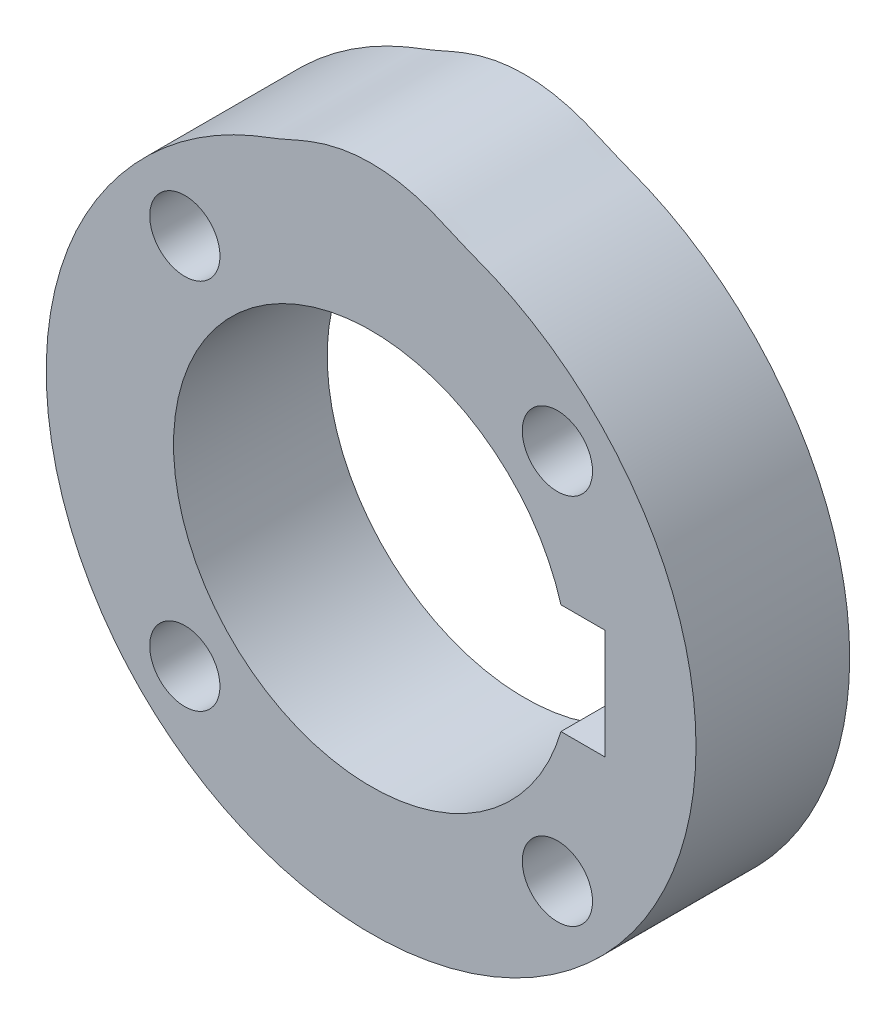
ISO-10303-21;
HEADER;
FILE_DESCRIPTION(('STEP AP214'),'2;1');
FILE_NAME('part.step','',(''),(''),'','','');
FILE_SCHEMA(('AUTOMOTIVE_DESIGN { 1 0 10303 214 1 1 1 1 }'));
ENDSEC;
DATA;
#1=APPLICATION_CONTEXT('core data for automotive mechanical design processes');
#2=APPLICATION_PROTOCOL_DEFINITION('international standard','automotive_design',2000,#1);
#3=PRODUCT_CONTEXT('',#1,'mechanical');
#4=PRODUCT('Part','Part','',(#3));
#5=PRODUCT_RELATED_PRODUCT_CATEGORY('part','',(#4));
#6=PRODUCT_DEFINITION_FORMATION('','',#4);
#7=PRODUCT_DEFINITION_CONTEXT('part definition',#1,'design');
#8=PRODUCT_DEFINITION('design','',#6,#7);
#9=PRODUCT_DEFINITION_SHAPE('','',#8);
#10=(LENGTH_UNIT() NAMED_UNIT(*) SI_UNIT(.MILLI.,.METRE.));
#11=(NAMED_UNIT(*) PLANE_ANGLE_UNIT() SI_UNIT($,.RADIAN.));
#12=(NAMED_UNIT(*) SI_UNIT($,.STERADIAN.) SOLID_ANGLE_UNIT());
#13=UNCERTAINTY_MEASURE_WITH_UNIT(LENGTH_MEASURE(1.E-05),#10,'distance_accuracy_value','');
#14=(GEOMETRIC_REPRESENTATION_CONTEXT(3) GLOBAL_UNCERTAINTY_ASSIGNED_CONTEXT((#13)) GLOBAL_UNIT_ASSIGNED_CONTEXT((#10,
#11,#12)) REPRESENTATION_CONTEXT('',''));
#15=CARTESIAN_POINT('',(0.,0.,0.));
#16=DIRECTION('',(0.,0.,1.));
#17=DIRECTION('',(1.,0.,0.));
#18=AXIS2_PLACEMENT_3D('',#15,#16,#17);
#19=CARTESIAN_POINT('',(0.,0.,14.));
#20=DIRECTION('',(0.,0.,1.));
#21=DIRECTION('',(1.,0.,0.));
#22=AXIS2_PLACEMENT_3D('',#19,#20,#21);
#23=PLANE('',#22);
#24=CARTESIAN_POINT('',(16.9705627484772,-16.9705627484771,14.));
#25=DIRECTION('',(0.,0.,1.));
#26=DIRECTION('',(1.,0.,0.));
#27=AXIS2_PLACEMENT_3D('',#24,#25,#26);
#28=CIRCLE('',#27,3.2);
#29=CARTESIAN_POINT('',(20.1705627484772,-16.9705627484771,14.));
#30=VERTEX_POINT('',#29);
#31=EDGE_CURVE('E183',#30,#30,#28,.T.);
#32=ORIENTED_EDGE('',*,*,#31,.F.);
#33=EDGE_LOOP('',(#32));
#34=FACE_BOUND('',#33,.T.);
#35=CARTESIAN_POINT('',(-16.9705627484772,16.9705627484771,14.));
#36=DIRECTION('',(0.,0.,1.));
#37=DIRECTION('',(1.,0.,0.));
#38=AXIS2_PLACEMENT_3D('',#35,#36,#37);
#39=CIRCLE('',#38,3.2);
#40=CARTESIAN_POINT('',(-13.7705627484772,16.9705627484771,14.));
#41=VERTEX_POINT('',#40);
#42=EDGE_CURVE('E90',#41,#41,#39,.T.);
#43=ORIENTED_EDGE('',*,*,#42,.F.);
#44=EDGE_LOOP('',(#43));
#45=FACE_BOUND('',#44,.T.);
#46=CARTESIAN_POINT('',(-22.8216800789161,18.8944464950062,14.));
#47=CARTESIAN_POINT('',(-22.7806762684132,18.9451245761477,14.));
#48=CARTESIAN_POINT('',(-22.6306491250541,19.1293817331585,14.));
#49=CARTESIAN_POINT('',(-22.3681874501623,19.4444235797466,14.));
#50=CARTESIAN_POINT('',(-22.0305061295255,19.836378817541,14.));
#51=CARTESIAN_POINT('',(-21.6864169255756,20.2228843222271,14.));
#52=CARTESIAN_POINT('',(-21.3359060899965,20.6038375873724,14.));
#53=CARTESIAN_POINT('',(-20.9789753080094,20.9789753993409,14.));
#54=CARTESIAN_POINT('',(-20.6159652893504,21.3484957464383,14.));
#55=CARTESIAN_POINT('',(-20.2466704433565,21.7119351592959,14.));
#56=CARTESIAN_POINT('',(-19.8713227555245,22.069386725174,14.));
#57=CARTESIAN_POINT('',(-19.4899970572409,22.4207306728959,14.));
#58=CARTESIAN_POINT('',(-19.1027118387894,22.7658137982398,14.));
#59=CARTESIAN_POINT('',(-18.70959413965,23.1045313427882,14.));
#60=CARTESIAN_POINT('',(-18.3107380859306,23.4367767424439,14.));
#61=CARTESIAN_POINT('',(-17.9062498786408,23.7624560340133,14.));
#62=CARTESIAN_POINT('',(-17.4962206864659,24.0815486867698,14.));
#63=CARTESIAN_POINT('',(-17.0805761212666,24.3936774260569,14.));
#64=CARTESIAN_POINT('',(-16.659715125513,24.6991552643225,14.));
#65=CARTESIAN_POINT('',(-16.2334593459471,24.997460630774,14.));
#66=CARTESIAN_POINT('',(-15.80202017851,25.2886331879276,14.));
#67=CARTESIAN_POINT('',(-15.3656479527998,25.5728124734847,14.));
#68=CARTESIAN_POINT('',(-14.9241846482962,25.8495022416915,14.));
#69=CARTESIAN_POINT('',(-14.4778699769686,26.118835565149,14.));
#70=CARTESIAN_POINT('',(-14.0267573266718,26.3806161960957,14.));
#71=CARTESIAN_POINT('',(-13.5710652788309,26.6348615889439,14.));
#72=CARTESIAN_POINT('',(-13.1108059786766,26.881251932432,14.));
#73=CARTESIAN_POINT('',(-12.6461699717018,27.119918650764,14.));
#74=CARTESIAN_POINT('',(-12.1771938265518,27.3505365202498,14.));
#75=CARTESIAN_POINT('',(-11.7041399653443,27.5733830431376,14.));
#76=CARTESIAN_POINT('',(-11.2269159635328,27.7877590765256,14.));
#77=CARTESIAN_POINT('',(-10.7459250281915,27.9942758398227,14.));
#78=CARTESIAN_POINT('',(-10.2610448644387,28.1922466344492,14.));
#79=CARTESIAN_POINT('',(-9.7724847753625,28.3819393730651,14.));
#80=CARTESIAN_POINT('',(-9.28239489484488,28.5696202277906,14.));
#81=CARTESIAN_POINT('',(-8.7923241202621,28.7609781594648,14.));
#82=CARTESIAN_POINT('',(-8.30283484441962,28.9596096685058,14.));
#83=CARTESIAN_POINT('',(-7.81386328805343,29.16702020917,14.));
#84=CARTESIAN_POINT('',(-7.32448286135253,29.3820685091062,14.));
#85=CARTESIAN_POINT('',(-6.83263830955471,29.5998133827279,14.));
#86=CARTESIAN_POINT('',(-6.33952180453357,29.8208796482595,14.));
#87=CARTESIAN_POINT('',(-5.83221445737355,30.013760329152,14.));
#88=CARTESIAN_POINT('',(-5.33110537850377,30.2251240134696,14.));
#89=CARTESIAN_POINT('',(-4.81516498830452,30.4006850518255,14.));
#90=CARTESIAN_POINT('',(-4.2961889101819,30.5656123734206,14.));
#91=CARTESIAN_POINT('',(-3.77124817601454,30.7114549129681,14.));
#92=CARTESIAN_POINT('',(-3.24181186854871,30.8401710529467,14.));
#93=CARTESIAN_POINT('',(-2.70808172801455,30.9498655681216,14.));
#94=CARTESIAN_POINT('',(-2.17084612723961,31.0405704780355,14.));
#95=CARTESIAN_POINT('',(-1.6306920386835,31.1115992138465,14.));
#96=CARTESIAN_POINT('',(-1.08835926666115,31.1622123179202,14.));
#97=CARTESIAN_POINT('',(-0.647234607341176,31.1881157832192,14.));
#98=CARTESIAN_POINT('',(-0.387124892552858,31.194442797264,14.));
#99=CARTESIAN_POINT('',(-0.308461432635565,31.1958932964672,14.));
#100=CARTESIAN_POINT('',(-0.239926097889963,31.1971570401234,14.));
#101=CARTESIAN_POINT('',(-0.102842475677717,31.1989820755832,14.));
#102=CARTESIAN_POINT('',(0.102842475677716,31.1989820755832,14.));
#103=CARTESIAN_POINT('',(0.239926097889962,31.1971570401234,14.));
#104=CARTESIAN_POINT('',(0.308461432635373,31.1958932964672,14.));
#105=CARTESIAN_POINT('',(0.387124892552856,31.194442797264,14.));
#106=CARTESIAN_POINT('',(0.647234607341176,31.1881157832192,14.));
#107=CARTESIAN_POINT('',(1.08835926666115,31.1622123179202,14.));
#108=CARTESIAN_POINT('',(1.6306920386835,31.1115992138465,14.));
#109=CARTESIAN_POINT('',(2.17084612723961,31.0405704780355,14.));
#110=CARTESIAN_POINT('',(2.70808172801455,30.9498655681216,14.));
#111=CARTESIAN_POINT('',(3.24181186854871,30.8401710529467,14.));
#112=CARTESIAN_POINT('',(3.77124817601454,30.7114549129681,14.));
#113=CARTESIAN_POINT('',(4.2961889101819,30.5656123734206,14.));
#114=CARTESIAN_POINT('',(4.81516498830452,30.4006850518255,14.));
#115=CARTESIAN_POINT('',(5.33110537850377,30.2251240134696,14.));
#116=CARTESIAN_POINT('',(5.83221445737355,30.013760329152,14.));
#117=CARTESIAN_POINT('',(6.33952180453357,29.8208796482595,14.));
#118=CARTESIAN_POINT('',(6.83263830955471,29.5998133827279,14.));
#119=CARTESIAN_POINT('',(7.32448286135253,29.3820685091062,14.));
#120=CARTESIAN_POINT('',(7.81386328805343,29.16702020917,14.));
#121=CARTESIAN_POINT('',(8.30283484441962,28.9596096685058,14.));
#122=CARTESIAN_POINT('',(8.7923241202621,28.7609781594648,14.));
#123=CARTESIAN_POINT('',(9.28239489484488,28.5696202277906,14.));
#124=CARTESIAN_POINT('',(9.7724847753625,28.3819393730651,14.));
#125=CARTESIAN_POINT('',(10.2610448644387,28.1922466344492,14.));
#126=CARTESIAN_POINT('',(10.7459250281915,27.9942758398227,14.));
#127=CARTESIAN_POINT('',(11.2269159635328,27.7877590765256,14.));
#128=CARTESIAN_POINT('',(11.7041399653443,27.5733830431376,14.));
#129=CARTESIAN_POINT('',(12.1771938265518,27.3505365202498,14.));
#130=CARTESIAN_POINT('',(12.6461699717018,27.119918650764,14.));
#131=CARTESIAN_POINT('',(13.1108059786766,26.881251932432,14.));
#132=CARTESIAN_POINT('',(13.5710652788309,26.6348615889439,14.));
#133=CARTESIAN_POINT('',(14.0267573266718,26.3806161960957,14.));
#134=CARTESIAN_POINT('',(14.4778699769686,26.118835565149,14.));
#135=CARTESIAN_POINT('',(14.9241846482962,25.8495022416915,14.));
#136=CARTESIAN_POINT('',(15.3656479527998,25.5728124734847,14.));
#137=CARTESIAN_POINT('',(15.80202017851,25.2886331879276,14.));
#138=CARTESIAN_POINT('',(16.2334593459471,24.997460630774,14.));
#139=CARTESIAN_POINT('',(16.659715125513,24.6991552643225,14.));
#140=CARTESIAN_POINT('',(17.0805761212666,24.3936774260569,14.));
#141=CARTESIAN_POINT('',(17.4962206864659,24.0815486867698,14.));
#142=CARTESIAN_POINT('',(17.9062498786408,23.7624560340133,14.));
#143=CARTESIAN_POINT('',(18.3107380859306,23.4367767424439,14.));
#144=CARTESIAN_POINT('',(18.70959413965,23.1045313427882,14.));
#145=CARTESIAN_POINT('',(19.1027118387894,22.7658137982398,14.));
#146=CARTESIAN_POINT('',(19.4899970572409,22.4207306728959,14.));
#147=CARTESIAN_POINT('',(19.8713227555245,22.069386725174,14.));
#148=CARTESIAN_POINT('',(20.2466704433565,21.7119351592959,14.));
#149=CARTESIAN_POINT('',(20.6159652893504,21.3484957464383,14.));
#150=CARTESIAN_POINT('',(20.9789753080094,20.9789753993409,14.));
#151=CARTESIAN_POINT('',(21.3359060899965,20.6038375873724,14.));
#152=CARTESIAN_POINT('',(21.6864169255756,20.2228843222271,14.));
#153=CARTESIAN_POINT('',(22.0305061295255,19.836378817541,14.));
#154=CARTESIAN_POINT('',(22.3681874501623,19.4444235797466,14.));
#155=CARTESIAN_POINT('',(22.6306491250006,19.1293817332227,14.));
#156=CARTESIAN_POINT('',(22.7806762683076,18.9451245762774,14.));
#157=CARTESIAN_POINT('',(22.8216800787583,18.8944464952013,14.));
#158=CARTESIAN_POINT('',(23.246798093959,18.3690278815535,14.));
#159=CARTESIAN_POINT('',(24.0633833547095,17.2909637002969,14.));
#160=CARTESIAN_POINT('',(25.187166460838,15.5907682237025,14.));
#161=CARTESIAN_POINT('',(25.8589745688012,14.4170102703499,14.));
#162=CARTESIAN_POINT('',(26.175760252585,13.8199869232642,14.));
#163=CARTESIAN_POINT('',(26.3877715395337,13.4204243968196,14.));
#164=CARTESIAN_POINT('',(26.7946676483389,12.6122118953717,14.));
#165=CARTESIAN_POINT('',(27.3419728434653,11.3663191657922,14.));
#166=CARTESIAN_POINT('',(27.6700801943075,10.5230092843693,14.));
#167=CARTESIAN_POINT('',(27.824387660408,10.0978173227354,14.));
#168=CARTESIAN_POINT('',(35.5238813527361,-11.1180247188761,14.));
#169=CARTESIAN_POINT('',(22.5697619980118,-29.6000416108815,14.));
#170=CARTESIAN_POINT('',(-1.31028136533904E-10,-29.6000416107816,14.));
#171=CARTESIAN_POINT('',(-22.5697619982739,-29.6000416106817,14.));
#172=CARTESIAN_POINT('',(-35.5238813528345,-11.1180247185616,14.));
#173=CARTESIAN_POINT('',(-27.8243876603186,10.0978173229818,14.));
#174=CARTESIAN_POINT('',(-27.6700801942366,10.523009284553,14.));
#175=CARTESIAN_POINT('',(-27.341972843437,11.3663191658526,14.));
#176=CARTESIAN_POINT('',(-26.7946676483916,12.6122118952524,14.));
#177=CARTESIAN_POINT('',(-26.3877715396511,13.4204243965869,14.));
#178=CARTESIAN_POINT('',(-26.1757602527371,13.8199869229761,14.));
#179=CARTESIAN_POINT('',(-25.8589745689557,14.4170102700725,14.));
#180=CARTESIAN_POINT('',(-25.1871664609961,15.5907682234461,14.));
#181=CARTESIAN_POINT('',(-24.0633833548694,17.290963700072,14.));
#182=CARTESIAN_POINT('',(-23.2467980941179,18.3690278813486,14.));
#183=CARTESIAN_POINT('',(-22.8216800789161,18.8944464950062,14.));
#184=(BOUNDED_CURVE() B_SPLINE_CURVE(3,(#46,#47,#48,#49,#50,#51,#52,#53,#54,#55,#56,#57,#58,#59,
#60,#61,#62,#63,#64,#65,#66,#67,#68,#69,#70,#71,#72,#73,#74,#75,#76,#77,#78,#79,#80,#81,#82,#83,
#84,#85,#86,#87,#88,#89,#90,#91,#92,#93,#94,#95,#96,#97,#98,#99,#100,#101,#102,#103,#104,#105,
#106,#107,#108,#109,#110,#111,#112,#113,#114,#115,#116,#117,#118,#119,#120,#121,#122,#123,#124,
#125,#126,#127,#128,#129,#130,#131,#132,#133,#134,#135,#136,#137,#138,#139,#140,#141,#142,#143,
#144,#145,#146,#147,#148,#149,#150,#151,#152,#153,#154,#155,#156,#157,#158,#159,#160,#161,#162,
#163,#164,#165,#166,#167,#168,#169,#170,#171,#172,#173,#174,#175,#176,#177,#178,#179,#180,#181,
#182,#183),.UNSPECIFIED.,.T.,.F.) B_SPLINE_CURVE_WITH_KNOTS((4,1,1,1,1,1,1,1,1,1,1,1,1,1,1,1,1,
1,1,1,1,1,1,1,1,1,1,1,1,1,1,1,1,1,1,1,1,1,1,1,1,1,1,1,1,1,1,1,1,1,1,3,1,1,3,1,1,1,1,1,1,1,1,1,1,
1,1,1,1,1,1,1,1,1,1,1,1,1,1,1,1,1,1,1,1,1,1,1,1,1,1,1,1,1,1,1,1,1,1,1,1,1,1,1,1,3,1,1,3,1,1,3,3,
3,1,1,3,1,1,4),(0.,0.0011475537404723,0.0041827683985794,0.00721801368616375,0.0102545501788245,
0.0132919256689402,0.0163305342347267,0.0193695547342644,0.0224102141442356,0.0254512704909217,
0.0284935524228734,0.0315374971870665,0.0345822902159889,0.0376279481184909,0.0406753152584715,
0.0437235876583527,0.046773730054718,0.049825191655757,0.0528778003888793,0.0559319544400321,
0.0589875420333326,0.0620444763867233,0.0651031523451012,0.0681636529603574,0.0712255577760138,
0.074288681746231,0.0773534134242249,0.0804203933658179,0.0834881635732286,0.0865582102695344,
0.0896295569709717,0.0927024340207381,0.0957774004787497,0.0988553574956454,0.101940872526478,
0.105038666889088,0.108154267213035,0.111290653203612,0.114448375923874,0.117623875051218,
0.120800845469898,0.124000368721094,0.127194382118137,0.130389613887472,0.133586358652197,
0.136782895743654,0.139979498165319,0.143176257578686,0.146372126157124,0.149567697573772,
0.152763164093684,0.154148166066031,0.155354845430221,0.15656152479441,0.157768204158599,
0.159153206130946,0.162348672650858,0.165544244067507,0.168740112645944,0.171936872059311,
0.175133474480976,0.178330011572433,0.181526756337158,0.184721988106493,0.187916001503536,
0.191115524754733,0.194292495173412,0.197467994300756,0.200625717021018,0.203762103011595,
0.206877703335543,0.209975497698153,0.213061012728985,0.216138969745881,0.219213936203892,
0.222286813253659,0.225358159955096,0.228428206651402,0.231495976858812,0.234562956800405,
0.237627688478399,0.240690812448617,0.243752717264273,0.246813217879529,0.249871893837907,
0.252928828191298,0.255984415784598,0.259038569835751,0.262091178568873,0.265142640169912,
0.268192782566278,0.271241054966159,0.274288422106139,0.277334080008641,0.280378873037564,
0.283422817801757,0.286465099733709,0.289506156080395,0.292546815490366,0.295585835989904,
0.29862444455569,0.301661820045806,0.304698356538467,0.307733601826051,0.310768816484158,
0.311916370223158,0.323813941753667,0.335711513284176,0.347609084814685,0.355571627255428,
0.363534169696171,0.371496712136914,0.655958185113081,0.940419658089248,0.948382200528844,
0.95634474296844,0.964307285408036,0.976204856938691,0.988102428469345,1.),
.UNSPECIFIED.) CURVE() GEOMETRIC_REPRESENTATION_ITEM() RATIONAL_B_SPLINE_CURVE((1.,1.,1.,1.,1.,
1.,1.,1.,1.,1.,1.,1.,1.,1.,1.,1.,1.,1.,1.,1.,1.,1.,1.,1.,1.,1.,1.,1.,1.,1.,1.,1.,1.,1.,1.,1.,1.,
1.,1.,1.,1.,1.,1.,1.,1.,1.,1.,1.,1.,1.,1.,1.,1.,1.,1.,1.,1.,1.,1.,1.,1.,1.,1.,1.,1.,1.,1.,1.,1.,
1.,1.,1.,1.,1.,1.,1.,1.,1.,1.,1.,1.,1.,1.,1.,1.,1.,1.,1.,1.,1.,1.,1.,1.,1.,1.,1.,1.,1.,1.,1.,1.,
1.,1.,1.,1.,1.,1.,1.,1.,1.,1.,1.,1.,1.,1.,1.,1.,1.,1.,1.,1.,1.,0.715972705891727,
0.715972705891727,1.,0.715972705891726,0.715972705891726,1.,1.,1.,1.,1.,1.,1.,1.,1.,1.,1.)) REPRESENTATION_ITEM(''));
#185=CARTESIAN_POINT('',(-22.8216800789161,18.8944464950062,14.));
#186=VERTEX_POINT('',#185);
#187=EDGE_CURVE('E45',#186,#186,#184,.T.);
#188=ORIENTED_EDGE('',*,*,#187,.F.);
#189=EDGE_LOOP('',(#188));
#190=FACE_BOUND('',#189,.T.);
#191=DIRECTION('',(0.,-1.,0.));
#192=VECTOR('',#191,1.);
#193=CARTESIAN_POINT('',(21.3,0.,14.));
#194=LINE('',#193,#192);
#195=CARTESIAN_POINT('',(21.3,5.,14.));
#196=VERTEX_POINT('',#195);
#197=CARTESIAN_POINT('',(21.3,-5.,14.));
#198=VERTEX_POINT('',#197);
#199=EDGE_CURVE('E76',#196,#198,#194,.T.);
#200=ORIENTED_EDGE('',*,*,#199,.T.);
#201=DIRECTION('',(1.,0.,0.));
#202=VECTOR('',#201,1.);
#203=CARTESIAN_POINT('',(0.,-5.,14.));
#204=LINE('',#203,#202);
#205=CARTESIAN_POINT('',(17.2916164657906,-5.,14.));
#206=VERTEX_POINT('',#205);
#207=EDGE_CURVE('E82',#206,#198,#204,.T.);
#208=ORIENTED_EDGE('',*,*,#207,.F.);
#209=CARTESIAN_POINT('',(0.,0.,14.));
#210=DIRECTION('',(0.,0.,1.));
#211=DIRECTION('',(1.,0.,0.));
#212=AXIS2_PLACEMENT_3D('',#209,#210,#211);
#213=CIRCLE('',#212,18.);
#214=CARTESIAN_POINT('',(17.2916164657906,5.,14.));
#215=VERTEX_POINT('',#214);
#216=EDGE_CURVE('E11',#215,#206,#213,.T.);
#217=ORIENTED_EDGE('',*,*,#216,.F.);
#218=DIRECTION('',(1.,0.,0.));
#219=VECTOR('',#218,1.);
#220=CARTESIAN_POINT('',(0.,5.,14.));
#221=LINE('',#220,#219);
#222=EDGE_CURVE('E99',#215,#196,#221,.T.);
#223=ORIENTED_EDGE('',*,*,#222,.T.);
#224=EDGE_LOOP('',(#200,#208,#217,#223));
#225=FACE_BOUND('',#224,.T.);
#226=CARTESIAN_POINT('',(-16.9705627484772,-16.9705627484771,14.));
#227=DIRECTION('',(0.,0.,1.));
#228=DIRECTION('',(1.,0.,0.));
#229=AXIS2_PLACEMENT_3D('',#226,#227,#228);
#230=CIRCLE('',#229,3.2);
#231=CARTESIAN_POINT('',(-13.7705627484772,-16.9705627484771,14.));
#232=VERTEX_POINT('',#231);
#233=EDGE_CURVE('E189',#232,#232,#230,.T.);
#234=ORIENTED_EDGE('',*,*,#233,.F.);
#235=EDGE_LOOP('',(#234));
#236=FACE_BOUND('',#235,.T.);
#237=CARTESIAN_POINT('',(16.9705627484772,16.9705627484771,14.));
#238=DIRECTION('',(0.,0.,1.));
#239=DIRECTION('',(1.,0.,0.));
#240=AXIS2_PLACEMENT_3D('',#237,#238,#239);
#241=CIRCLE('',#240,3.2);
#242=CARTESIAN_POINT('',(20.1705627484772,16.9705627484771,14.));
#243=VERTEX_POINT('',#242);
#244=EDGE_CURVE('E174',#243,#243,#241,.T.);
#245=ORIENTED_EDGE('',*,*,#244,.F.);
#246=EDGE_LOOP('',(#245));
#247=FACE_BOUND('',#246,.T.);
#248=ADVANCED_FACE('F35',(#34,#45,#190,#225,#236,#247),#23,.T.);
#249=CARTESIAN_POINT('',(0.,0.,0.));
#250=DIRECTION('',(0.,0.,1.));
#251=DIRECTION('',(1.,0.,0.));
#252=AXIS2_PLACEMENT_3D('',#249,#250,#251);
#253=PLANE('',#252);
#254=CARTESIAN_POINT('',(16.9705627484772,-16.9705627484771,0.));
#255=DIRECTION('',(0.,0.,1.));
#256=DIRECTION('',(1.,0.,0.));
#257=AXIS2_PLACEMENT_3D('',#254,#255,#256);
#258=CIRCLE('',#257,3.2);
#259=CARTESIAN_POINT('',(20.1705627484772,-16.9705627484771,0.));
#260=VERTEX_POINT('',#259);
#261=EDGE_CURVE('E180',#260,#260,#258,.T.);
#262=ORIENTED_EDGE('',*,*,#261,.T.);
#263=EDGE_LOOP('',(#262));
#264=FACE_BOUND('',#263,.T.);
#265=CARTESIAN_POINT('',(-16.9705627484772,16.9705627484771,0.));
#266=DIRECTION('',(0.,0.,1.));
#267=DIRECTION('',(1.,0.,0.));
#268=AXIS2_PLACEMENT_3D('',#265,#266,#267);
#269=CIRCLE('',#268,3.2);
#270=CARTESIAN_POINT('',(-13.7705627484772,16.9705627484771,0.));
#271=VERTEX_POINT('',#270);
#272=EDGE_CURVE('E192',#271,#271,#269,.T.);
#273=ORIENTED_EDGE('',*,*,#272,.T.);
#274=EDGE_LOOP('',(#273));
#275=FACE_BOUND('',#274,.T.);
#276=CARTESIAN_POINT('',(-22.8216800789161,18.8944464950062,0.));
#277=CARTESIAN_POINT('',(-22.7806762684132,18.9451245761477,0.));
#278=CARTESIAN_POINT('',(-22.6306491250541,19.1293817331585,0.));
#279=CARTESIAN_POINT('',(-22.3681874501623,19.4444235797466,0.));
#280=CARTESIAN_POINT('',(-22.0305061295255,19.836378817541,0.));
#281=CARTESIAN_POINT('',(-21.6864169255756,20.2228843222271,0.));
#282=CARTESIAN_POINT('',(-21.3359060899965,20.6038375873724,0.));
#283=CARTESIAN_POINT('',(-20.9789753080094,20.9789753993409,0.));
#284=CARTESIAN_POINT('',(-20.6159652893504,21.3484957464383,0.));
#285=CARTESIAN_POINT('',(-20.2466704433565,21.7119351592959,0.));
#286=CARTESIAN_POINT('',(-19.8713227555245,22.069386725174,0.));
#287=CARTESIAN_POINT('',(-19.4899970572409,22.4207306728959,0.));
#288=CARTESIAN_POINT('',(-19.1027118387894,22.7658137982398,0.));
#289=CARTESIAN_POINT('',(-18.70959413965,23.1045313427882,0.));
#290=CARTESIAN_POINT('',(-18.3107380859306,23.4367767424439,0.));
#291=CARTESIAN_POINT('',(-17.9062498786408,23.7624560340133,0.));
#292=CARTESIAN_POINT('',(-17.4962206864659,24.0815486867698,0.));
#293=CARTESIAN_POINT('',(-17.0805761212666,24.3936774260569,0.));
#294=CARTESIAN_POINT('',(-16.659715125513,24.6991552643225,0.));
#295=CARTESIAN_POINT('',(-16.2334593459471,24.997460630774,0.));
#296=CARTESIAN_POINT('',(-15.80202017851,25.2886331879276,0.));
#297=CARTESIAN_POINT('',(-15.3656479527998,25.5728124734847,0.));
#298=CARTESIAN_POINT('',(-14.9241846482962,25.8495022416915,0.));
#299=CARTESIAN_POINT('',(-14.4778699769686,26.118835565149,0.));
#300=CARTESIAN_POINT('',(-14.0267573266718,26.3806161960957,0.));
#301=CARTESIAN_POINT('',(-13.5710652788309,26.6348615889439,0.));
#302=CARTESIAN_POINT('',(-13.1108059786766,26.881251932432,0.));
#303=CARTESIAN_POINT('',(-12.6461699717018,27.119918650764,0.));
#304=CARTESIAN_POINT('',(-12.1771938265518,27.3505365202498,0.));
#305=CARTESIAN_POINT('',(-11.7041399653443,27.5733830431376,0.));
#306=CARTESIAN_POINT('',(-11.2269159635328,27.7877590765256,0.));
#307=CARTESIAN_POINT('',(-10.7459250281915,27.9942758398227,0.));
#308=CARTESIAN_POINT('',(-10.2610448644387,28.1922466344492,0.));
#309=CARTESIAN_POINT('',(-9.7724847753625,28.3819393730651,0.));
#310=CARTESIAN_POINT('',(-9.28239489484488,28.5696202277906,0.));
#311=CARTESIAN_POINT('',(-8.7923241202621,28.7609781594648,0.));
#312=CARTESIAN_POINT('',(-8.30283484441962,28.9596096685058,0.));
#313=CARTESIAN_POINT('',(-7.81386328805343,29.16702020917,0.));
#314=CARTESIAN_POINT('',(-7.32448286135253,29.3820685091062,0.));
#315=CARTESIAN_POINT('',(-6.83263830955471,29.5998133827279,0.));
#316=CARTESIAN_POINT('',(-6.33952180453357,29.8208796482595,0.));
#317=CARTESIAN_POINT('',(-5.83221445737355,30.013760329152,0.));
#318=CARTESIAN_POINT('',(-5.33110537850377,30.2251240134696,0.));
#319=CARTESIAN_POINT('',(-4.81516498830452,30.4006850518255,0.));
#320=CARTESIAN_POINT('',(-4.2961889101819,30.5656123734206,0.));
#321=CARTESIAN_POINT('',(-3.77124817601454,30.7114549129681,0.));
#322=CARTESIAN_POINT('',(-3.24181186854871,30.8401710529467,0.));
#323=CARTESIAN_POINT('',(-2.70808172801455,30.9498655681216,0.));
#324=CARTESIAN_POINT('',(-2.17084612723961,31.0405704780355,0.));
#325=CARTESIAN_POINT('',(-1.6306920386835,31.1115992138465,0.));
#326=CARTESIAN_POINT('',(-1.08835926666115,31.1622123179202,0.));
#327=CARTESIAN_POINT('',(-0.647234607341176,31.1881157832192,0.));
#328=CARTESIAN_POINT('',(-0.387124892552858,31.194442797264,0.));
#329=CARTESIAN_POINT('',(-0.308461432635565,31.1958932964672,0.));
#330=CARTESIAN_POINT('',(-0.239926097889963,31.1971570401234,0.));
#331=CARTESIAN_POINT('',(-0.102842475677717,31.1989820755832,0.));
#332=CARTESIAN_POINT('',(0.102842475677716,31.1989820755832,0.));
#333=CARTESIAN_POINT('',(0.239926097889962,31.1971570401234,0.));
#334=CARTESIAN_POINT('',(0.308461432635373,31.1958932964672,0.));
#335=CARTESIAN_POINT('',(0.387124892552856,31.194442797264,0.));
#336=CARTESIAN_POINT('',(0.647234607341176,31.1881157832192,0.));
#337=CARTESIAN_POINT('',(1.08835926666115,31.1622123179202,0.));
#338=CARTESIAN_POINT('',(1.6306920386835,31.1115992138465,0.));
#339=CARTESIAN_POINT('',(2.17084612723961,31.0405704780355,0.));
#340=CARTESIAN_POINT('',(2.70808172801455,30.9498655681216,0.));
#341=CARTESIAN_POINT('',(3.24181186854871,30.8401710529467,0.));
#342=CARTESIAN_POINT('',(3.77124817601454,30.7114549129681,0.));
#343=CARTESIAN_POINT('',(4.2961889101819,30.5656123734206,0.));
#344=CARTESIAN_POINT('',(4.81516498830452,30.4006850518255,0.));
#345=CARTESIAN_POINT('',(5.33110537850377,30.2251240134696,0.));
#346=CARTESIAN_POINT('',(5.83221445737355,30.013760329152,0.));
#347=CARTESIAN_POINT('',(6.33952180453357,29.8208796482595,0.));
#348=CARTESIAN_POINT('',(6.83263830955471,29.5998133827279,0.));
#349=CARTESIAN_POINT('',(7.32448286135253,29.3820685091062,0.));
#350=CARTESIAN_POINT('',(7.81386328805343,29.16702020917,0.));
#351=CARTESIAN_POINT('',(8.30283484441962,28.9596096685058,0.));
#352=CARTESIAN_POINT('',(8.7923241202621,28.7609781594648,0.));
#353=CARTESIAN_POINT('',(9.28239489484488,28.5696202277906,0.));
#354=CARTESIAN_POINT('',(9.7724847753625,28.3819393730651,0.));
#355=CARTESIAN_POINT('',(10.2610448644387,28.1922466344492,0.));
#356=CARTESIAN_POINT('',(10.7459250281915,27.9942758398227,0.));
#357=CARTESIAN_POINT('',(11.2269159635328,27.7877590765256,0.));
#358=CARTESIAN_POINT('',(11.7041399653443,27.5733830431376,0.));
#359=CARTESIAN_POINT('',(12.1771938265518,27.3505365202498,0.));
#360=CARTESIAN_POINT('',(12.6461699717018,27.119918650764,0.));
#361=CARTESIAN_POINT('',(13.1108059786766,26.881251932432,0.));
#362=CARTESIAN_POINT('',(13.5710652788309,26.6348615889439,0.));
#363=CARTESIAN_POINT('',(14.0267573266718,26.3806161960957,0.));
#364=CARTESIAN_POINT('',(14.4778699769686,26.118835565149,0.));
#365=CARTESIAN_POINT('',(14.9241846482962,25.8495022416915,0.));
#366=CARTESIAN_POINT('',(15.3656479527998,25.5728124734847,0.));
#367=CARTESIAN_POINT('',(15.80202017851,25.2886331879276,0.));
#368=CARTESIAN_POINT('',(16.2334593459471,24.997460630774,0.));
#369=CARTESIAN_POINT('',(16.659715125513,24.6991552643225,0.));
#370=CARTESIAN_POINT('',(17.0805761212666,24.3936774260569,0.));
#371=CARTESIAN_POINT('',(17.4962206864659,24.0815486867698,0.));
#372=CARTESIAN_POINT('',(17.9062498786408,23.7624560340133,0.));
#373=CARTESIAN_POINT('',(18.3107380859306,23.4367767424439,0.));
#374=CARTESIAN_POINT('',(18.70959413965,23.1045313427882,0.));
#375=CARTESIAN_POINT('',(19.1027118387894,22.7658137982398,0.));
#376=CARTESIAN_POINT('',(19.4899970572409,22.4207306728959,0.));
#377=CARTESIAN_POINT('',(19.8713227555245,22.069386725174,0.));
#378=CARTESIAN_POINT('',(20.2466704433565,21.7119351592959,0.));
#379=CARTESIAN_POINT('',(20.6159652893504,21.3484957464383,0.));
#380=CARTESIAN_POINT('',(20.9789753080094,20.9789753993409,0.));
#381=CARTESIAN_POINT('',(21.3359060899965,20.6038375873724,0.));
#382=CARTESIAN_POINT('',(21.6864169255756,20.2228843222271,0.));
#383=CARTESIAN_POINT('',(22.0305061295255,19.836378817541,0.));
#384=CARTESIAN_POINT('',(22.3681874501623,19.4444235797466,0.));
#385=CARTESIAN_POINT('',(22.6306491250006,19.1293817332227,0.));
#386=CARTESIAN_POINT('',(22.7806762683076,18.9451245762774,0.));
#387=CARTESIAN_POINT('',(22.8216800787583,18.8944464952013,0.));
#388=CARTESIAN_POINT('',(23.246798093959,18.3690278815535,0.));
#389=CARTESIAN_POINT('',(24.0633833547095,17.2909637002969,0.));
#390=CARTESIAN_POINT('',(25.187166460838,15.5907682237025,0.));
#391=CARTESIAN_POINT('',(25.8589745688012,14.4170102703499,0.));
#392=CARTESIAN_POINT('',(26.175760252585,13.8199869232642,0.));
#393=CARTESIAN_POINT('',(26.3877715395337,13.4204243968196,0.));
#394=CARTESIAN_POINT('',(26.7946676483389,12.6122118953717,0.));
#395=CARTESIAN_POINT('',(27.3419728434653,11.3663191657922,0.));
#396=CARTESIAN_POINT('',(27.6700801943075,10.5230092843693,0.));
#397=CARTESIAN_POINT('',(27.824387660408,10.0978173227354,0.));
#398=CARTESIAN_POINT('',(35.5238813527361,-11.1180247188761,0.));
#399=CARTESIAN_POINT('',(22.5697619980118,-29.6000416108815,0.));
#400=CARTESIAN_POINT('',(-1.31028136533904E-10,-29.6000416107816,0.));
#401=CARTESIAN_POINT('',(-22.5697619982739,-29.6000416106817,0.));
#402=CARTESIAN_POINT('',(-35.5238813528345,-11.1180247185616,0.));
#403=CARTESIAN_POINT('',(-27.8243876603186,10.0978173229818,0.));
#404=CARTESIAN_POINT('',(-27.6700801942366,10.523009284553,0.));
#405=CARTESIAN_POINT('',(-27.341972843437,11.3663191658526,0.));
#406=CARTESIAN_POINT('',(-26.7946676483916,12.6122118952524,0.));
#407=CARTESIAN_POINT('',(-26.3877715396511,13.4204243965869,0.));
#408=CARTESIAN_POINT('',(-26.1757602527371,13.8199869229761,0.));
#409=CARTESIAN_POINT('',(-25.8589745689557,14.4170102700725,0.));
#410=CARTESIAN_POINT('',(-25.1871664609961,15.5907682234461,0.));
#411=CARTESIAN_POINT('',(-24.0633833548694,17.290963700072,0.));
#412=CARTESIAN_POINT('',(-23.2467980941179,18.3690278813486,0.));
#413=CARTESIAN_POINT('',(-22.8216800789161,18.8944464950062,0.));
#414=(BOUNDED_CURVE() B_SPLINE_CURVE(3,(#276,#277,#278,#279,#280,#281,#282,#283,#284,#285,#286,
#287,#288,#289,#290,#291,#292,#293,#294,#295,#296,#297,#298,#299,#300,#301,#302,#303,#304,#305,
#306,#307,#308,#309,#310,#311,#312,#313,#314,#315,#316,#317,#318,#319,#320,#321,#322,#323,#324,
#325,#326,#327,#328,#329,#330,#331,#332,#333,#334,#335,#336,#337,#338,#339,#340,#341,#342,#343,
#344,#345,#346,#347,#348,#349,#350,#351,#352,#353,#354,#355,#356,#357,#358,#359,#360,#361,#362,
#363,#364,#365,#366,#367,#368,#369,#370,#371,#372,#373,#374,#375,#376,#377,#378,#379,#380,#381,
#382,#383,#384,#385,#386,#387,#388,#389,#390,#391,#392,#393,#394,#395,#396,#397,#398,#399,#400,
#401,#402,#403,#404,#405,#406,#407,#408,#409,#410,#411,#412,#413),.UNSPECIFIED.,.T.,
.F.) B_SPLINE_CURVE_WITH_KNOTS((4,1,1,1,1,1,1,1,1,1,1,1,1,1,1,1,1,1,1,1,1,1,1,1,1,1,1,1,1,1,1,1,
1,1,1,1,1,1,1,1,1,1,1,1,1,1,1,1,1,1,1,3,1,1,3,1,1,1,1,1,1,1,1,1,1,1,1,1,1,1,1,1,1,1,1,1,1,1,1,1,
1,1,1,1,1,1,1,1,1,1,1,1,1,1,1,1,1,1,1,1,1,1,1,1,1,3,1,1,3,1,1,3,3,3,1,1,3,1,1,4),(0.,
0.0011475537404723,0.0041827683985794,0.00721801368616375,0.0102545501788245,0.0132919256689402,
0.0163305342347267,0.0193695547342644,0.0224102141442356,0.0254512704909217,0.0284935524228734,
0.0315374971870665,0.0345822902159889,0.0376279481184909,0.0406753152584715,0.0437235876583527,
0.046773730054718,0.049825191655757,0.0528778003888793,0.0559319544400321,0.0589875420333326,
0.0620444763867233,0.0651031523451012,0.0681636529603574,0.0712255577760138,0.074288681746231,
0.0773534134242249,0.0804203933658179,0.0834881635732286,0.0865582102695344,0.0896295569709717,
0.0927024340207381,0.0957774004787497,0.0988553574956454,0.101940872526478,0.105038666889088,
0.108154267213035,0.111290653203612,0.114448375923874,0.117623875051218,0.120800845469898,
0.124000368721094,0.127194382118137,0.130389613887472,0.133586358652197,0.136782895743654,
0.139979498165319,0.143176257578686,0.146372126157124,0.149567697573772,0.152763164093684,
0.154148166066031,0.155354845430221,0.15656152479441,0.157768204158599,0.159153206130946,
0.162348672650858,0.165544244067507,0.168740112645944,0.171936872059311,0.175133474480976,
0.178330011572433,0.181526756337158,0.184721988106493,0.187916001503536,0.191115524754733,
0.194292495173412,0.197467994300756,0.200625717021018,0.203762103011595,0.206877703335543,
0.209975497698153,0.213061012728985,0.216138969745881,0.219213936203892,0.222286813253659,
0.225358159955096,0.228428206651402,0.231495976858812,0.234562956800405,0.237627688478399,
0.240690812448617,0.243752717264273,0.246813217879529,0.249871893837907,0.252928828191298,
0.255984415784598,0.259038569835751,0.262091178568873,0.265142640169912,0.268192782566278,
0.271241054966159,0.274288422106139,0.277334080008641,0.280378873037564,0.283422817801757,
0.286465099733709,0.289506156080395,0.292546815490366,0.295585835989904,0.29862444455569,
0.301661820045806,0.304698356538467,0.307733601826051,0.310768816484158,0.311916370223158,
0.323813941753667,0.335711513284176,0.347609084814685,0.355571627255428,0.363534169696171,
0.371496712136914,0.655958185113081,0.940419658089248,0.948382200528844,0.95634474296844,
0.964307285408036,0.976204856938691,0.988102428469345,1.),
.UNSPECIFIED.) CURVE() GEOMETRIC_REPRESENTATION_ITEM() RATIONAL_B_SPLINE_CURVE((1.,1.,1.,1.,1.,
1.,1.,1.,1.,1.,1.,1.,1.,1.,1.,1.,1.,1.,1.,1.,1.,1.,1.,1.,1.,1.,1.,1.,1.,1.,1.,1.,1.,1.,1.,1.,1.,
1.,1.,1.,1.,1.,1.,1.,1.,1.,1.,1.,1.,1.,1.,1.,1.,1.,1.,1.,1.,1.,1.,1.,1.,1.,1.,1.,1.,1.,1.,1.,1.,
1.,1.,1.,1.,1.,1.,1.,1.,1.,1.,1.,1.,1.,1.,1.,1.,1.,1.,1.,1.,1.,1.,1.,1.,1.,1.,1.,1.,1.,1.,1.,1.,
1.,1.,1.,1.,1.,1.,1.,1.,1.,1.,1.,1.,1.,1.,1.,1.,1.,1.,1.,1.,1.,0.715972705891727,
0.715972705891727,1.,0.715972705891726,0.715972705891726,1.,1.,1.,1.,1.,1.,1.,1.,1.,1.,1.)) REPRESENTATION_ITEM(''));
#415=CARTESIAN_POINT('',(-22.8216800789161,18.8944464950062,0.));
#416=VERTEX_POINT('',#415);
#417=EDGE_CURVE('E108',#416,#416,#414,.T.);
#418=ORIENTED_EDGE('',*,*,#417,.T.);
#419=EDGE_LOOP('',(#418));
#420=FACE_BOUND('',#419,.T.);
#421=DIRECTION('',(1.,0.,0.));
#422=VECTOR('',#421,1.);
#423=CARTESIAN_POINT('',(0.,-5.,0.));
#424=LINE('',#423,#422);
#425=CARTESIAN_POINT('',(17.2916164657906,-5.,0.));
#426=VERTEX_POINT('',#425);
#427=CARTESIAN_POINT('',(21.3,-5.,0.));
#428=VERTEX_POINT('',#427);
#429=EDGE_CURVE('E106',#426,#428,#424,.T.);
#430=ORIENTED_EDGE('',*,*,#429,.T.);
#431=DIRECTION('',(0.,-1.,0.));
#432=VECTOR('',#431,1.);
#433=CARTESIAN_POINT('',(21.3,0.,0.));
#434=LINE('',#433,#432);
#435=CARTESIAN_POINT('',(21.3,5.,0.));
#436=VERTEX_POINT('',#435);
#437=EDGE_CURVE('E94',#436,#428,#434,.T.);
#438=ORIENTED_EDGE('',*,*,#437,.F.);
#439=DIRECTION('',(1.,0.,0.));
#440=VECTOR('',#439,1.);
#441=CARTESIAN_POINT('',(0.,5.,0.));
#442=LINE('',#441,#440);
#443=CARTESIAN_POINT('',(17.2916164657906,5.,0.));
#444=VERTEX_POINT('',#443);
#445=EDGE_CURVE('E89',#444,#436,#442,.T.);
#446=ORIENTED_EDGE('',*,*,#445,.F.);
#447=CARTESIAN_POINT('',(0.,0.,0.));
#448=DIRECTION('',(0.,0.,1.));
#449=DIRECTION('',(1.,0.,0.));
#450=AXIS2_PLACEMENT_3D('',#447,#448,#449);
#451=CIRCLE('',#450,18.);
#452=EDGE_CURVE('E40',#444,#426,#451,.T.);
#453=ORIENTED_EDGE('',*,*,#452,.T.);
#454=EDGE_LOOP('',(#430,#438,#446,#453));
#455=FACE_BOUND('',#454,.T.);
#456=CARTESIAN_POINT('',(-16.9705627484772,-16.9705627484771,0.));
#457=DIRECTION('',(0.,0.,1.));
#458=DIRECTION('',(1.,0.,0.));
#459=AXIS2_PLACEMENT_3D('',#456,#457,#458);
#460=CIRCLE('',#459,3.2);
#461=CARTESIAN_POINT('',(-13.7705627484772,-16.9705627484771,0.));
#462=VERTEX_POINT('',#461);
#463=EDGE_CURVE('E186',#462,#462,#460,.T.);
#464=ORIENTED_EDGE('',*,*,#463,.T.);
#465=EDGE_LOOP('',(#464));
#466=FACE_BOUND('',#465,.T.);
#467=CARTESIAN_POINT('',(16.9705627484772,16.9705627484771,0.));
#468=DIRECTION('',(0.,0.,1.));
#469=DIRECTION('',(1.,0.,0.));
#470=AXIS2_PLACEMENT_3D('',#467,#468,#469);
#471=CIRCLE('',#470,3.2);
#472=CARTESIAN_POINT('',(20.1705627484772,16.9705627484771,0.));
#473=VERTEX_POINT('',#472);
#474=EDGE_CURVE('E177',#473,#473,#471,.T.);
#475=ORIENTED_EDGE('',*,*,#474,.T.);
#476=EDGE_LOOP('',(#475));
#477=FACE_BOUND('',#476,.T.);
#478=ADVANCED_FACE('F127',(#264,#275,#420,#455,#466,#477),#253,.F.);
#479=CARTESIAN_POINT('',(0.,0.,14.));
#480=DIRECTION('',(0.,0.,-1.));
#481=DIRECTION('',(-1.,0.,0.));
#482=AXIS2_PLACEMENT_3D('',#479,#480,#481);
#483=CYLINDRICAL_SURFACE('',#482,18.);
#484=ORIENTED_EDGE('',*,*,#216,.T.);
#485=DIRECTION('',(0.,0.,-1.));
#486=VECTOR('',#485,1.);
#487=CARTESIAN_POINT('',(17.2916164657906,-5.,24.773445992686));
#488=LINE('',#487,#486);
#489=EDGE_CURVE('E86',#206,#426,#488,.T.);
#490=ORIENTED_EDGE('',*,*,#489,.T.);
#491=ORIENTED_EDGE('',*,*,#452,.F.);
#492=DIRECTION('',(0.,0.,-1.));
#493=VECTOR('',#492,1.);
#494=CARTESIAN_POINT('',(17.2916164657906,5.,24.773445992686));
#495=LINE('',#494,#493);
#496=EDGE_CURVE('E53',#215,#444,#495,.T.);
#497=ORIENTED_EDGE('',*,*,#496,.F.);
#498=EDGE_LOOP('',(#484,#490,#491,#497));
#499=FACE_BOUND('',#498,.T.);
#500=ADVANCED_FACE('F130',(#499),#483,.F.);
#501=DIRECTION('',(0.,0.,-1.));
#502=VECTOR('',#501,1.);
#503=SURFACE_OF_LINEAR_EXTRUSION('',#184,#502);
#504=ORIENTED_EDGE('',*,*,#187,.T.);
#505=EDGE_LOOP('',(#504));
#506=FACE_BOUND('',#505,.T.);
#507=ORIENTED_EDGE('',*,*,#417,.F.);
#508=EDGE_LOOP('',(#507));
#509=FACE_BOUND('',#508,.T.);
#510=ADVANCED_FACE('F37',(#506,#509),#503,.T.);
#511=CARTESIAN_POINT('',(21.3,0.,24.773445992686));
#512=DIRECTION('',(1.,0.,0.));
#513=DIRECTION('',(0.,0.,-1.));
#514=AXIS2_PLACEMENT_3D('',#511,#512,#513);
#515=PLANE('',#514);
#516=DIRECTION('',(0.,0.,-1.));
#517=VECTOR('',#516,1.);
#518=CARTESIAN_POINT('',(21.3,5.,24.773445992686));
#519=LINE('',#518,#517);
#520=EDGE_CURVE('E62',#196,#436,#519,.T.);
#521=ORIENTED_EDGE('',*,*,#520,.T.);
#522=ORIENTED_EDGE('',*,*,#437,.T.);
#523=DIRECTION('',(0.,0.,-1.));
#524=VECTOR('',#523,1.);
#525=CARTESIAN_POINT('',(21.3,-5.,24.773445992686));
#526=LINE('',#525,#524);
#527=EDGE_CURVE('E84',#198,#428,#526,.T.);
#528=ORIENTED_EDGE('',*,*,#527,.F.);
#529=ORIENTED_EDGE('',*,*,#199,.F.);
#530=EDGE_LOOP('',(#521,#522,#528,#529));
#531=FACE_BOUND('',#530,.T.);
#532=ADVANCED_FACE('F92',(#531),#515,.F.);
#533=CARTESIAN_POINT('',(0.,-5.,24.773445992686));
#534=DIRECTION('',(0.,1.,0.));
#535=DIRECTION('',(0.,0.,1.));
#536=AXIS2_PLACEMENT_3D('',#533,#534,#535);
#537=PLANE('',#536);
#538=ORIENTED_EDGE('',*,*,#207,.T.);
#539=ORIENTED_EDGE('',*,*,#527,.T.);
#540=ORIENTED_EDGE('',*,*,#429,.F.);
#541=ORIENTED_EDGE('',*,*,#489,.F.);
#542=EDGE_LOOP('',(#538,#539,#540,#541));
#543=FACE_BOUND('',#542,.T.);
#544=ADVANCED_FACE('F83',(#543),#537,.T.);
#545=CARTESIAN_POINT('',(0.,5.,24.773445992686));
#546=DIRECTION('',(0.,1.,0.));
#547=DIRECTION('',(0.,0.,1.));
#548=AXIS2_PLACEMENT_3D('',#545,#546,#547);
#549=PLANE('',#548);
#550=ORIENTED_EDGE('',*,*,#496,.T.);
#551=ORIENTED_EDGE('',*,*,#445,.T.);
#552=ORIENTED_EDGE('',*,*,#520,.F.);
#553=ORIENTED_EDGE('',*,*,#222,.F.);
#554=EDGE_LOOP('',(#550,#551,#552,#553));
#555=FACE_BOUND('',#554,.T.);
#556=ADVANCED_FACE('F151',(#555),#549,.F.);
#557=CARTESIAN_POINT('',(-16.9705627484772,16.9705627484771,14.));
#558=DIRECTION('',(0.,0.,-1.));
#559=DIRECTION('',(-1.,0.,0.));
#560=AXIS2_PLACEMENT_3D('',#557,#558,#559);
#561=CYLINDRICAL_SURFACE('',#560,3.2);
#562=ORIENTED_EDGE('',*,*,#42,.T.);
#563=EDGE_LOOP('',(#562));
#564=FACE_BOUND('',#563,.T.);
#565=ORIENTED_EDGE('',*,*,#272,.F.);
#566=EDGE_LOOP('',(#565));
#567=FACE_BOUND('',#566,.T.);
#568=ADVANCED_FACE('F154',(#564,#567),#561,.F.);
#569=CARTESIAN_POINT('',(-16.9705627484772,-16.9705627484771,14.));
#570=DIRECTION('',(0.,0.,-1.));
#571=DIRECTION('',(-1.,0.,0.));
#572=AXIS2_PLACEMENT_3D('',#569,#570,#571);
#573=CYLINDRICAL_SURFACE('',#572,3.2);
#574=ORIENTED_EDGE('',*,*,#233,.T.);
#575=EDGE_LOOP('',(#574));
#576=FACE_BOUND('',#575,.T.);
#577=ORIENTED_EDGE('',*,*,#463,.F.);
#578=EDGE_LOOP('',(#577));
#579=FACE_BOUND('',#578,.T.);
#580=ADVANCED_FACE('F157',(#576,#579),#573,.F.);
#581=CARTESIAN_POINT('',(16.9705627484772,-16.9705627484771,14.));
#582=DIRECTION('',(0.,0.,-1.));
#583=DIRECTION('',(-1.,0.,0.));
#584=AXIS2_PLACEMENT_3D('',#581,#582,#583);
#585=CYLINDRICAL_SURFACE('',#584,3.2);
#586=ORIENTED_EDGE('',*,*,#31,.T.);
#587=EDGE_LOOP('',(#586));
#588=FACE_BOUND('',#587,.T.);
#589=ORIENTED_EDGE('',*,*,#261,.F.);
#590=EDGE_LOOP('',(#589));
#591=FACE_BOUND('',#590,.T.);
#592=ADVANCED_FACE('F161',(#588,#591),#585,.F.);
#593=CARTESIAN_POINT('',(16.9705627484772,16.9705627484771,14.));
#594=DIRECTION('',(0.,0.,-1.));
#595=DIRECTION('',(-1.,0.,0.));
#596=AXIS2_PLACEMENT_3D('',#593,#594,#595);
#597=CYLINDRICAL_SURFACE('',#596,3.2);
#598=ORIENTED_EDGE('',*,*,#244,.T.);
#599=EDGE_LOOP('',(#598));
#600=FACE_BOUND('',#599,.T.);
#601=ORIENTED_EDGE('',*,*,#474,.F.);
#602=EDGE_LOOP('',(#601));
#603=FACE_BOUND('',#602,.T.);
#604=ADVANCED_FACE('F165',(#600,#603),#597,.F.);
#605=CLOSED_SHELL('',(#248,#478,#500,#510,#532,#544,#556,#568,#580,#592,#604));
#606=MANIFOLD_SOLID_BREP('B2',#605);
#607=ADVANCED_BREP_SHAPE_REPRESENTATION('',(#18,#606),#14);
#608=SHAPE_DEFINITION_REPRESENTATION(#9,#607);
ENDSEC;
END-ISO-10303-21;
